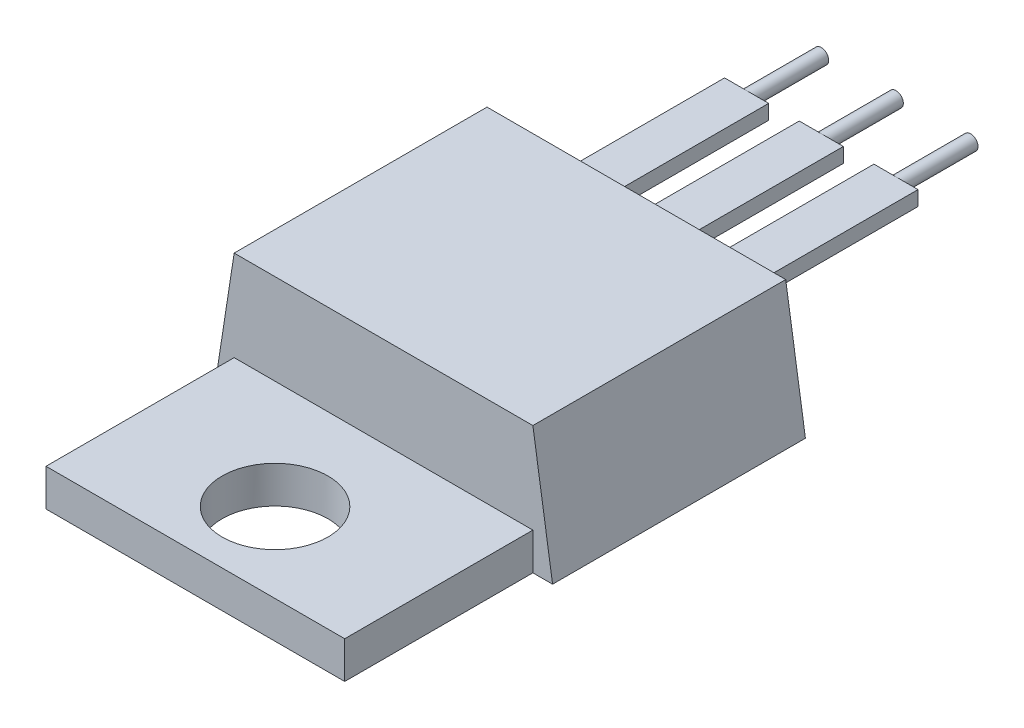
ISO-10303-21;
HEADER;
FILE_DESCRIPTION(('STEP AP214'),'2;1');
FILE_NAME('part.step','',(''),(''),'','','');
FILE_SCHEMA(('AUTOMOTIVE_DESIGN { 1 0 10303 214 1 1 1 1 }'));
ENDSEC;
DATA;
#1=APPLICATION_CONTEXT('core data for automotive mechanical design processes');
#2=APPLICATION_PROTOCOL_DEFINITION('international standard','automotive_design',2000,#1);
#3=PRODUCT_CONTEXT('',#1,'mechanical');
#4=PRODUCT('Part','Part','',(#3));
#5=PRODUCT_RELATED_PRODUCT_CATEGORY('part','',(#4));
#6=PRODUCT_DEFINITION_FORMATION('','',#4);
#7=PRODUCT_DEFINITION_CONTEXT('part definition',#1,'design');
#8=PRODUCT_DEFINITION('design','',#6,#7);
#9=PRODUCT_DEFINITION_SHAPE('','',#8);
#10=(LENGTH_UNIT() NAMED_UNIT(*) SI_UNIT(.MILLI.,.METRE.));
#11=(NAMED_UNIT(*) PLANE_ANGLE_UNIT() SI_UNIT($,.RADIAN.));
#12=(NAMED_UNIT(*) SI_UNIT($,.STERADIAN.) SOLID_ANGLE_UNIT());
#13=UNCERTAINTY_MEASURE_WITH_UNIT(LENGTH_MEASURE(1.E-05),#10,'distance_accuracy_value','');
#14=(GEOMETRIC_REPRESENTATION_CONTEXT(3) GLOBAL_UNCERTAINTY_ASSIGNED_CONTEXT((#13)) GLOBAL_UNIT_ASSIGNED_CONTEXT((#10,
#11,#12)) REPRESENTATION_CONTEXT('',''));
#15=CARTESIAN_POINT('',(0.,0.,0.));
#16=DIRECTION('',(0.,0.,1.));
#17=DIRECTION('',(1.,0.,0.));
#18=AXIS2_PLACEMENT_3D('',#15,#16,#17);
#19=CARTESIAN_POINT('',(-1.79,-0.25,-6.29));
#20=DIRECTION('',(0.,0.,-1.));
#21=DIRECTION('',(-1.,0.,0.));
#22=AXIS2_PLACEMENT_3D('',#19,#20,#21);
#23=PLANE('',#22);
#24=CARTESIAN_POINT('',(-2.54,0.,-6.29));
#25=DIRECTION('',(0.,0.,-1.));
#26=DIRECTION('',(-1.,0.,0.));
#27=AXIS2_PLACEMENT_3D('',#24,#25,#26);
#28=CIRCLE('',#27,0.25);
#29=CARTESIAN_POINT('',(-2.54,0.25,-6.29));
#30=VERTEX_POINT('',#29);
#31=CARTESIAN_POINT('',(-2.54,-0.25,-6.29));
#32=VERTEX_POINT('',#31);
#33=EDGE_CURVE('E52',#30,#32,#28,.T.);
#34=ORIENTED_EDGE('',*,*,#33,.F.);
#35=DIRECTION('',(1.,0.,0.));
#36=VECTOR('',#35,1.);
#37=CARTESIAN_POINT('',(-1.79,0.25,-6.29));
#38=LINE('',#37,#36);
#39=CARTESIAN_POINT('',(-1.79,0.25,-6.29));
#40=VERTEX_POINT('',#39);
#41=EDGE_CURVE('E66',#30,#40,#38,.T.);
#42=ORIENTED_EDGE('',*,*,#41,.T.);
#43=DIRECTION('',(0.,-1.,0.));
#44=VECTOR('',#43,1.);
#45=CARTESIAN_POINT('',(-1.79,0.25,-6.29));
#46=LINE('',#45,#44);
#47=CARTESIAN_POINT('',(-1.79,-0.25,-6.29));
#48=VERTEX_POINT('',#47);
#49=EDGE_CURVE('E159',#40,#48,#46,.T.);
#50=ORIENTED_EDGE('',*,*,#49,.T.);
#51=DIRECTION('',(-1.,0.,0.));
#52=VECTOR('',#51,1.);
#53=CARTESIAN_POINT('',(-1.79,-0.25,-6.29));
#54=LINE('',#53,#52);
#55=EDGE_CURVE('E95',#48,#32,#54,.T.);
#56=ORIENTED_EDGE('',*,*,#55,.T.);
#57=EDGE_LOOP('',(#34,#42,#50,#56));
#58=FACE_BOUND('',#57,.T.);
#59=ADVANCED_FACE('F42',(#58),#23,.T.);
#60=CARTESIAN_POINT('',(-1.79,0.25,-6.29));
#61=DIRECTION('',(-1.,0.,0.));
#62=DIRECTION('',(0.,-1.,0.));
#63=AXIS2_PLACEMENT_3D('',#60,#61,#62);
#64=PLANE('',#63);
#65=DIRECTION('',(0.,-1.,0.));
#66=VECTOR('',#65,1.);
#67=CARTESIAN_POINT('',(-1.79,0.25,0.));
#68=LINE('',#67,#66);
#69=CARTESIAN_POINT('',(-1.79,0.25,0.));
#70=VERTEX_POINT('',#69);
#71=CARTESIAN_POINT('',(-1.79,-0.25,0.));
#72=VERTEX_POINT('',#71);
#73=EDGE_CURVE('E155',#70,#72,#68,.T.);
#74=ORIENTED_EDGE('',*,*,#73,.T.);
#75=DIRECTION('',(0.,0.,1.));
#76=VECTOR('',#75,1.);
#77=CARTESIAN_POINT('',(-1.79,-0.25,-6.29));
#78=LINE('',#77,#76);
#79=EDGE_CURVE('E46',#48,#72,#78,.T.);
#80=ORIENTED_EDGE('',*,*,#79,.F.);
#81=ORIENTED_EDGE('',*,*,#49,.F.);
#82=DIRECTION('',(0.,0.,1.));
#83=VECTOR('',#82,1.);
#84=CARTESIAN_POINT('',(-1.79,0.25,-6.29));
#85=LINE('',#84,#83);
#86=EDGE_CURVE('E103',#40,#70,#85,.T.);
#87=ORIENTED_EDGE('',*,*,#86,.T.);
#88=EDGE_LOOP('',(#74,#80,#81,#87));
#89=FACE_BOUND('',#88,.T.);
#90=ADVANCED_FACE('F44',(#89),#64,.F.);
#91=CARTESIAN_POINT('',(-1.79,-0.25,-6.29));
#92=DIRECTION('',(0.,1.,0.));
#93=DIRECTION('',(0.,0.,1.));
#94=AXIS2_PLACEMENT_3D('',#91,#92,#93);
#95=PLANE('',#94);
#96=DIRECTION('',(-1.,0.,0.));
#97=VECTOR('',#96,1.);
#98=CARTESIAN_POINT('',(-1.79,-0.25,0.));
#99=LINE('',#98,#97);
#100=CARTESIAN_POINT('',(-3.29,-0.25,0.));
#101=VERTEX_POINT('',#100);
#102=EDGE_CURVE('E147',#72,#101,#99,.T.);
#103=ORIENTED_EDGE('',*,*,#102,.T.);
#104=DIRECTION('',(0.,0.,1.));
#105=VECTOR('',#104,1.);
#106=CARTESIAN_POINT('',(-3.29,-0.25,-6.29));
#107=LINE('',#106,#105);
#108=CARTESIAN_POINT('',(-3.29,-0.25,-6.29));
#109=VERTEX_POINT('',#108);
#110=EDGE_CURVE('E149',#109,#101,#107,.T.);
#111=ORIENTED_EDGE('',*,*,#110,.F.);
#112=EDGE_CURVE('E169',#32,#109,#54,.T.);
#113=ORIENTED_EDGE('',*,*,#112,.F.);
#114=ORIENTED_EDGE('',*,*,#55,.F.);
#115=ORIENTED_EDGE('',*,*,#79,.T.);
#116=EDGE_LOOP('',(#103,#111,#113,#114,#115));
#117=FACE_BOUND('',#116,.T.);
#118=ADVANCED_FACE('F130',(#117),#95,.F.);
#119=CARTESIAN_POINT('',(-3.29,0.25,-6.29));
#120=DIRECTION('',(1.,0.,0.));
#121=DIRECTION('',(0.,0.,-1.));
#122=AXIS2_PLACEMENT_3D('',#119,#120,#121);
#123=PLANE('',#122);
#124=DIRECTION('',(0.,1.,0.));
#125=VECTOR('',#124,1.);
#126=CARTESIAN_POINT('',(-3.29,0.25,0.));
#127=LINE('',#126,#125);
#128=CARTESIAN_POINT('',(-3.29,0.25,0.));
#129=VERTEX_POINT('',#128);
#130=EDGE_CURVE('E154',#101,#129,#127,.T.);
#131=ORIENTED_EDGE('',*,*,#130,.T.);
#132=DIRECTION('',(0.,0.,1.));
#133=VECTOR('',#132,1.);
#134=CARTESIAN_POINT('',(-3.29,0.25,-6.29));
#135=LINE('',#134,#133);
#136=CARTESIAN_POINT('',(-3.29,0.25,-6.29));
#137=VERTEX_POINT('',#136);
#138=EDGE_CURVE('E157',#137,#129,#135,.T.);
#139=ORIENTED_EDGE('',*,*,#138,.F.);
#140=DIRECTION('',(0.,1.,0.));
#141=VECTOR('',#140,1.);
#142=CARTESIAN_POINT('',(-3.29,0.25,-6.29));
#143=LINE('',#142,#141);
#144=EDGE_CURVE('E101',#109,#137,#143,.T.);
#145=ORIENTED_EDGE('',*,*,#144,.F.);
#146=ORIENTED_EDGE('',*,*,#110,.T.);
#147=EDGE_LOOP('',(#131,#139,#145,#146));
#148=FACE_BOUND('',#147,.T.);
#149=ADVANCED_FACE('F136',(#148),#123,.F.);
#150=CARTESIAN_POINT('',(-1.79,0.25,-6.29));
#151=DIRECTION('',(0.,-1.,0.));
#152=DIRECTION('',(0.,0.,-1.));
#153=AXIS2_PLACEMENT_3D('',#150,#151,#152);
#154=PLANE('',#153);
#155=DIRECTION('',(1.,0.,0.));
#156=VECTOR('',#155,1.);
#157=CARTESIAN_POINT('',(-1.79,0.25,0.));
#158=LINE('',#157,#156);
#159=EDGE_CURVE('E88',#129,#70,#158,.T.);
#160=ORIENTED_EDGE('',*,*,#159,.T.);
#161=ORIENTED_EDGE('',*,*,#86,.F.);
#162=ORIENTED_EDGE('',*,*,#41,.F.);
#163=EDGE_CURVE('E98',#137,#30,#38,.T.);
#164=ORIENTED_EDGE('',*,*,#163,.F.);
#165=ORIENTED_EDGE('',*,*,#138,.T.);
#166=EDGE_LOOP('',(#160,#161,#162,#164,#165));
#167=FACE_BOUND('',#166,.T.);
#168=ADVANCED_FACE('F105',(#167),#154,.F.);
#169=EDGE_CURVE('E12',#32,#30,#28,.T.);
#170=ORIENTED_EDGE('',*,*,#169,.F.);
#171=ORIENTED_EDGE('',*,*,#112,.T.);
#172=ORIENTED_EDGE('',*,*,#144,.T.);
#173=ORIENTED_EDGE('',*,*,#163,.T.);
#174=EDGE_LOOP('',(#170,#171,#172,#173));
#175=FACE_BOUND('',#174,.T.);
#176=ADVANCED_FACE('F99',(#175),#23,.T.);
#177=CARTESIAN_POINT('',(-1.79,-0.25,0.));
#178=DIRECTION('',(0.,0.,-1.));
#179=DIRECTION('',(-1.,0.,0.));
#180=AXIS2_PLACEMENT_3D('',#177,#178,#179);
#181=PLANE('',#180);
#182=ORIENTED_EDGE('',*,*,#73,.F.);
#183=ORIENTED_EDGE('',*,*,#159,.F.);
#184=ORIENTED_EDGE('',*,*,#130,.F.);
#185=ORIENTED_EDGE('',*,*,#102,.F.);
#186=EDGE_LOOP('',(#182,#183,#184,#185));
#187=FACE_BOUND('',#186,.T.);
#188=ADVANCED_FACE('F113',(#187),#181,.F.);
#189=CARTESIAN_POINT('',(-2.54,0.,-8.83));
#190=DIRECTION('',(0.,0.,1.));
#191=DIRECTION('',(1.,0.,0.));
#192=AXIS2_PLACEMENT_3D('',#189,#190,#191);
#193=CYLINDRICAL_SURFACE('',#192,0.25);
#194=CARTESIAN_POINT('',(-2.54,0.,-8.83));
#195=DIRECTION('',(0.,0.,-1.));
#196=DIRECTION('',(-1.,0.,0.));
#197=AXIS2_PLACEMENT_3D('',#194,#195,#196);
#198=CIRCLE('',#197,0.25);
#199=CARTESIAN_POINT('',(-2.79,0.,-8.83));
#200=VERTEX_POINT('',#199);
#201=EDGE_CURVE('E109',#200,#200,#198,.T.);
#202=ORIENTED_EDGE('',*,*,#201,.F.);
#203=EDGE_LOOP('',(#202));
#204=FACE_BOUND('',#203,.T.);
#205=ORIENTED_EDGE('',*,*,#33,.T.);
#206=ORIENTED_EDGE('',*,*,#169,.T.);
#207=EDGE_LOOP('',(#205,#206));
#208=FACE_BOUND('',#207,.T.);
#209=ADVANCED_FACE('F110',(#204,#208),#193,.T.);
#210=CARTESIAN_POINT('',(-2.54,0.,-8.83));
#211=DIRECTION('',(0.,0.,-1.));
#212=DIRECTION('',(-1.,0.,0.));
#213=AXIS2_PLACEMENT_3D('',#210,#211,#212);
#214=PLANE('',#213);
#215=ORIENTED_EDGE('',*,*,#201,.T.);
#216=EDGE_LOOP('',(#215));
#217=FACE_BOUND('',#216,.T.);
#218=ADVANCED_FACE('F112',(#217),#214,.T.);
#219=CLOSED_SHELL('',(#59,#90,#118,#149,#168,#176,#188,#209,#218));
#220=MANIFOLD_SOLID_BREP('B2',#219);
#221=CARTESIAN_POINT('',(1.79,-0.25,-6.29));
#222=DIRECTION('',(0.,0.,1.));
#223=DIRECTION('',(1.,0.,0.));
#224=AXIS2_PLACEMENT_3D('',#221,#222,#223);
#225=PLANE('',#224);
#226=CARTESIAN_POINT('',(2.54,0.,-6.29));
#227=DIRECTION('',(0.,0.,-1.));
#228=DIRECTION('',(-1.,0.,0.));
#229=AXIS2_PLACEMENT_3D('',#226,#227,#228);
#230=CIRCLE('',#229,0.25);
#231=CARTESIAN_POINT('',(2.54,0.25,-6.29));
#232=VERTEX_POINT('',#231);
#233=CARTESIAN_POINT('',(2.54,-0.25,-6.29));
#234=VERTEX_POINT('',#233);
#235=EDGE_CURVE('E237',#232,#234,#230,.T.);
#236=ORIENTED_EDGE('',*,*,#235,.F.);
#237=DIRECTION('',(1.,0.,0.));
#238=VECTOR('',#237,1.);
#239=CARTESIAN_POINT('',(1.79,0.25,-6.29));
#240=LINE('',#239,#238);
#241=CARTESIAN_POINT('',(3.29,0.25,-6.29));
#242=VERTEX_POINT('',#241);
#243=EDGE_CURVE('E284',#232,#242,#240,.T.);
#244=ORIENTED_EDGE('',*,*,#243,.T.);
#245=DIRECTION('',(0.,-1.,0.));
#246=VECTOR('',#245,1.);
#247=CARTESIAN_POINT('',(3.29,0.25,-6.29));
#248=LINE('',#247,#246);
#249=CARTESIAN_POINT('',(3.29,-0.25,-6.29));
#250=VERTEX_POINT('',#249);
#251=EDGE_CURVE('E283',#242,#250,#248,.T.);
#252=ORIENTED_EDGE('',*,*,#251,.T.);
#253=DIRECTION('',(-1.,0.,0.));
#254=VECTOR('',#253,1.);
#255=CARTESIAN_POINT('',(1.79,-0.25,-6.29));
#256=LINE('',#255,#254);
#257=EDGE_CURVE('E296',#250,#234,#256,.T.);
#258=ORIENTED_EDGE('',*,*,#257,.T.);
#259=EDGE_LOOP('',(#236,#244,#252,#258));
#260=FACE_BOUND('',#259,.T.);
#261=ADVANCED_FACE('F227',(#260),#225,.F.);
#262=EDGE_CURVE('E40',#234,#232,#230,.T.);
#263=ORIENTED_EDGE('',*,*,#262,.F.);
#264=CARTESIAN_POINT('',(1.79,-0.25,-6.29));
#265=VERTEX_POINT('',#264);
#266=EDGE_CURVE('E247',#234,#265,#256,.T.);
#267=ORIENTED_EDGE('',*,*,#266,.T.);
#268=DIRECTION('',(0.,1.,0.));
#269=VECTOR('',#268,1.);
#270=CARTESIAN_POINT('',(1.79,0.25,-6.29));
#271=LINE('',#270,#269);
#272=CARTESIAN_POINT('',(1.79,0.25,-6.29));
#273=VERTEX_POINT('',#272);
#274=EDGE_CURVE('E281',#265,#273,#271,.T.);
#275=ORIENTED_EDGE('',*,*,#274,.T.);
#276=EDGE_CURVE('E276',#273,#232,#240,.T.);
#277=ORIENTED_EDGE('',*,*,#276,.T.);
#278=EDGE_LOOP('',(#263,#267,#275,#277));
#279=FACE_BOUND('',#278,.T.);
#280=ADVANCED_FACE('F279',(#279),#225,.F.);
#281=CARTESIAN_POINT('',(1.79,0.25,-6.29));
#282=DIRECTION('',(1.,0.,0.));
#283=DIRECTION('',(0.,0.,-1.));
#284=AXIS2_PLACEMENT_3D('',#281,#282,#283);
#285=PLANE('',#284);
#286=DIRECTION('',(0.,1.,0.));
#287=VECTOR('',#286,1.);
#288=CARTESIAN_POINT('',(1.79,0.25,0.));
#289=LINE('',#288,#287);
#290=CARTESIAN_POINT('',(1.79,-0.25,0.));
#291=VERTEX_POINT('',#290);
#292=CARTESIAN_POINT('',(1.79,0.25,0.));
#293=VERTEX_POINT('',#292);
#294=EDGE_CURVE('E335',#291,#293,#289,.T.);
#295=ORIENTED_EDGE('',*,*,#294,.T.);
#296=DIRECTION('',(0.,0.,1.));
#297=VECTOR('',#296,1.);
#298=CARTESIAN_POINT('',(1.79,0.25,-6.29));
#299=LINE('',#298,#297);
#300=EDGE_CURVE('E231',#273,#293,#299,.T.);
#301=ORIENTED_EDGE('',*,*,#300,.F.);
#302=ORIENTED_EDGE('',*,*,#274,.F.);
#303=DIRECTION('',(0.,0.,1.));
#304=VECTOR('',#303,1.);
#305=CARTESIAN_POINT('',(1.79,-0.25,-6.29));
#306=LINE('',#305,#304);
#307=EDGE_CURVE('E336',#265,#291,#306,.T.);
#308=ORIENTED_EDGE('',*,*,#307,.T.);
#309=EDGE_LOOP('',(#295,#301,#302,#308));
#310=FACE_BOUND('',#309,.T.);
#311=ADVANCED_FACE('F229',(#310),#285,.F.);
#312=CARTESIAN_POINT('',(1.79,0.25,-6.29));
#313=DIRECTION('',(0.,-1.,0.));
#314=DIRECTION('',(0.,0.,-1.));
#315=AXIS2_PLACEMENT_3D('',#312,#313,#314);
#316=PLANE('',#315);
#317=DIRECTION('',(1.,0.,0.));
#318=VECTOR('',#317,1.);
#319=CARTESIAN_POINT('',(1.79,0.25,0.));
#320=LINE('',#319,#318);
#321=CARTESIAN_POINT('',(3.29,0.25,0.));
#322=VERTEX_POINT('',#321);
#323=EDGE_CURVE('E337',#293,#322,#320,.T.);
#324=ORIENTED_EDGE('',*,*,#323,.T.);
#325=DIRECTION('',(0.,0.,1.));
#326=VECTOR('',#325,1.);
#327=CARTESIAN_POINT('',(3.29,0.25,-6.29));
#328=LINE('',#327,#326);
#329=EDGE_CURVE('E290',#242,#322,#328,.T.);
#330=ORIENTED_EDGE('',*,*,#329,.F.);
#331=ORIENTED_EDGE('',*,*,#243,.F.);
#332=ORIENTED_EDGE('',*,*,#276,.F.);
#333=ORIENTED_EDGE('',*,*,#300,.T.);
#334=EDGE_LOOP('',(#324,#330,#331,#332,#333));
#335=FACE_BOUND('',#334,.T.);
#336=ADVANCED_FACE('F288',(#335),#316,.F.);
#337=CARTESIAN_POINT('',(3.29,0.25,-6.29));
#338=DIRECTION('',(-1.,0.,0.));
#339=DIRECTION('',(0.,0.,1.));
#340=AXIS2_PLACEMENT_3D('',#337,#338,#339);
#341=PLANE('',#340);
#342=DIRECTION('',(0.,-1.,0.));
#343=VECTOR('',#342,1.);
#344=CARTESIAN_POINT('',(3.29,0.25,0.));
#345=LINE('',#344,#343);
#346=CARTESIAN_POINT('',(3.29,-0.25,0.));
#347=VERTEX_POINT('',#346);
#348=EDGE_CURVE('E339',#322,#347,#345,.T.);
#349=ORIENTED_EDGE('',*,*,#348,.T.);
#350=DIRECTION('',(0.,0.,1.));
#351=VECTOR('',#350,1.);
#352=CARTESIAN_POINT('',(3.29,-0.25,-6.29));
#353=LINE('',#352,#351);
#354=EDGE_CURVE('E349',#250,#347,#353,.T.);
#355=ORIENTED_EDGE('',*,*,#354,.F.);
#356=ORIENTED_EDGE('',*,*,#251,.F.);
#357=ORIENTED_EDGE('',*,*,#329,.T.);
#358=EDGE_LOOP('',(#349,#355,#356,#357));
#359=FACE_BOUND('',#358,.T.);
#360=ADVANCED_FACE('F323',(#359),#341,.F.);
#361=CARTESIAN_POINT('',(1.79,-0.25,-6.29));
#362=DIRECTION('',(0.,1.,0.));
#363=DIRECTION('',(0.,0.,1.));
#364=AXIS2_PLACEMENT_3D('',#361,#362,#363);
#365=PLANE('',#364);
#366=DIRECTION('',(-1.,0.,0.));
#367=VECTOR('',#366,1.);
#368=CARTESIAN_POINT('',(1.79,-0.25,0.));
#369=LINE('',#368,#367);
#370=EDGE_CURVE('E269',#347,#291,#369,.T.);
#371=ORIENTED_EDGE('',*,*,#370,.T.);
#372=ORIENTED_EDGE('',*,*,#307,.F.);
#373=ORIENTED_EDGE('',*,*,#266,.F.);
#374=ORIENTED_EDGE('',*,*,#257,.F.);
#375=ORIENTED_EDGE('',*,*,#354,.T.);
#376=EDGE_LOOP('',(#371,#372,#373,#374,#375));
#377=FACE_BOUND('',#376,.T.);
#378=ADVANCED_FACE('F311',(#377),#365,.F.);
#379=CARTESIAN_POINT('',(1.79,-0.25,0.));
#380=DIRECTION('',(0.,0.,1.));
#381=DIRECTION('',(1.,0.,0.));
#382=AXIS2_PLACEMENT_3D('',#379,#380,#381);
#383=PLANE('',#382);
#384=ORIENTED_EDGE('',*,*,#294,.F.);
#385=ORIENTED_EDGE('',*,*,#370,.F.);
#386=ORIENTED_EDGE('',*,*,#348,.F.);
#387=ORIENTED_EDGE('',*,*,#323,.F.);
#388=EDGE_LOOP('',(#384,#385,#386,#387));
#389=FACE_BOUND('',#388,.T.);
#390=ADVANCED_FACE('F302',(#389),#383,.T.);
#391=CARTESIAN_POINT('',(2.54,0.,-8.83));
#392=DIRECTION('',(0.,0.,1.));
#393=DIRECTION('',(1.,0.,0.));
#394=AXIS2_PLACEMENT_3D('',#391,#392,#393);
#395=CYLINDRICAL_SURFACE('',#394,0.25);
#396=CARTESIAN_POINT('',(2.54,0.,-8.83));
#397=DIRECTION('',(0.,0.,-1.));
#398=DIRECTION('',(-1.,0.,0.));
#399=AXIS2_PLACEMENT_3D('',#396,#397,#398);
#400=CIRCLE('',#399,0.25);
#401=CARTESIAN_POINT('',(2.29,0.,-8.83));
#402=VERTEX_POINT('',#401);
#403=EDGE_CURVE('E298',#402,#402,#400,.T.);
#404=ORIENTED_EDGE('',*,*,#403,.F.);
#405=EDGE_LOOP('',(#404));
#406=FACE_BOUND('',#405,.T.);
#407=ORIENTED_EDGE('',*,*,#235,.T.);
#408=ORIENTED_EDGE('',*,*,#262,.T.);
#409=EDGE_LOOP('',(#407,#408));
#410=FACE_BOUND('',#409,.T.);
#411=ADVANCED_FACE('F299',(#406,#410),#395,.T.);
#412=CARTESIAN_POINT('',(2.54,0.,-8.83));
#413=DIRECTION('',(0.,0.,-1.));
#414=DIRECTION('',(-1.,0.,0.));
#415=AXIS2_PLACEMENT_3D('',#412,#413,#414);
#416=PLANE('',#415);
#417=ORIENTED_EDGE('',*,*,#403,.T.);
#418=EDGE_LOOP('',(#417));
#419=FACE_BOUND('',#418,.T.);
#420=ADVANCED_FACE('F301',(#419),#416,.T.);
#421=CLOSED_SHELL('',(#261,#280,#311,#336,#360,#378,#390,#411,#420));
#422=MANIFOLD_SOLID_BREP('B6',#421);
#423=CARTESIAN_POINT('',(0.75,-0.25,-6.29));
#424=DIRECTION('',(0.,0.,-1.));
#425=DIRECTION('',(-1.,0.,0.));
#426=AXIS2_PLACEMENT_3D('',#423,#424,#425);
#427=PLANE('',#426);
#428=CARTESIAN_POINT('',(0.,0.,-6.29));
#429=DIRECTION('',(0.,0.,-1.));
#430=DIRECTION('',(-1.,0.,0.));
#431=AXIS2_PLACEMENT_3D('',#428,#429,#430);
#432=CIRCLE('',#431,0.25);
#433=CARTESIAN_POINT('',(0.,0.25,-6.29));
#434=VERTEX_POINT('',#433);
#435=CARTESIAN_POINT('',(0.,-0.25,-6.29));
#436=VERTEX_POINT('',#435);
#437=EDGE_CURVE('E422',#434,#436,#432,.T.);
#438=ORIENTED_EDGE('',*,*,#437,.F.);
#439=DIRECTION('',(1.,0.,0.));
#440=VECTOR('',#439,1.);
#441=CARTESIAN_POINT('',(0.75,0.25,-6.29));
#442=LINE('',#441,#440);
#443=CARTESIAN_POINT('',(0.75,0.25,-6.29));
#444=VERTEX_POINT('',#443);
#445=EDGE_CURVE('E436',#434,#444,#442,.T.);
#446=ORIENTED_EDGE('',*,*,#445,.T.);
#447=DIRECTION('',(0.,-1.,0.));
#448=VECTOR('',#447,1.);
#449=CARTESIAN_POINT('',(0.75,0.25,-6.29));
#450=LINE('',#449,#448);
#451=CARTESIAN_POINT('',(0.75,-0.25,-6.29));
#452=VERTEX_POINT('',#451);
#453=EDGE_CURVE('E529',#444,#452,#450,.T.);
#454=ORIENTED_EDGE('',*,*,#453,.T.);
#455=DIRECTION('',(-1.,0.,0.));
#456=VECTOR('',#455,1.);
#457=CARTESIAN_POINT('',(0.75,-0.25,-6.29));
#458=LINE('',#457,#456);
#459=EDGE_CURVE('E465',#452,#436,#458,.T.);
#460=ORIENTED_EDGE('',*,*,#459,.T.);
#461=EDGE_LOOP('',(#438,#446,#454,#460));
#462=FACE_BOUND('',#461,.T.);
#463=ADVANCED_FACE('F412',(#462),#427,.T.);
#464=CARTESIAN_POINT('',(0.75,0.25,-6.29));
#465=DIRECTION('',(-1.,0.,0.));
#466=DIRECTION('',(0.,0.,1.));
#467=AXIS2_PLACEMENT_3D('',#464,#465,#466);
#468=PLANE('',#467);
#469=DIRECTION('',(0.,-1.,0.));
#470=VECTOR('',#469,1.);
#471=CARTESIAN_POINT('',(0.75,0.25,0.));
#472=LINE('',#471,#470);
#473=CARTESIAN_POINT('',(0.75,0.25,0.));
#474=VERTEX_POINT('',#473);
#475=CARTESIAN_POINT('',(0.75,-0.25,0.));
#476=VERTEX_POINT('',#475);
#477=EDGE_CURVE('E525',#474,#476,#472,.T.);
#478=ORIENTED_EDGE('',*,*,#477,.T.);
#479=DIRECTION('',(0.,0.,1.));
#480=VECTOR('',#479,1.);
#481=CARTESIAN_POINT('',(0.75,-0.25,-6.29));
#482=LINE('',#481,#480);
#483=EDGE_CURVE('E416',#452,#476,#482,.T.);
#484=ORIENTED_EDGE('',*,*,#483,.F.);
#485=ORIENTED_EDGE('',*,*,#453,.F.);
#486=DIRECTION('',(0.,0.,1.));
#487=VECTOR('',#486,1.);
#488=CARTESIAN_POINT('',(0.75,0.25,-6.29));
#489=LINE('',#488,#487);
#490=EDGE_CURVE('E473',#444,#474,#489,.T.);
#491=ORIENTED_EDGE('',*,*,#490,.T.);
#492=EDGE_LOOP('',(#478,#484,#485,#491));
#493=FACE_BOUND('',#492,.T.);
#494=ADVANCED_FACE('F414',(#493),#468,.F.);
#495=CARTESIAN_POINT('',(0.75,-0.25,-6.29));
#496=DIRECTION('',(0.,1.,0.));
#497=DIRECTION('',(0.,0.,1.));
#498=AXIS2_PLACEMENT_3D('',#495,#496,#497);
#499=PLANE('',#498);
#500=DIRECTION('',(-1.,0.,0.));
#501=VECTOR('',#500,1.);
#502=CARTESIAN_POINT('',(0.75,-0.25,0.));
#503=LINE('',#502,#501);
#504=CARTESIAN_POINT('',(-0.75,-0.25,0.));
#505=VERTEX_POINT('',#504);
#506=EDGE_CURVE('E517',#476,#505,#503,.T.);
#507=ORIENTED_EDGE('',*,*,#506,.T.);
#508=DIRECTION('',(0.,0.,1.));
#509=VECTOR('',#508,1.);
#510=CARTESIAN_POINT('',(-0.75,-0.25,-6.29));
#511=LINE('',#510,#509);
#512=CARTESIAN_POINT('',(-0.75,-0.25,-6.29));
#513=VERTEX_POINT('',#512);
#514=EDGE_CURVE('E519',#513,#505,#511,.T.);
#515=ORIENTED_EDGE('',*,*,#514,.F.);
#516=EDGE_CURVE('E539',#436,#513,#458,.T.);
#517=ORIENTED_EDGE('',*,*,#516,.F.);
#518=ORIENTED_EDGE('',*,*,#459,.F.);
#519=ORIENTED_EDGE('',*,*,#483,.T.);
#520=EDGE_LOOP('',(#507,#515,#517,#518,#519));
#521=FACE_BOUND('',#520,.T.);
#522=ADVANCED_FACE('F500',(#521),#499,.F.);
#523=CARTESIAN_POINT('',(-0.75,0.25,-6.29));
#524=DIRECTION('',(1.,0.,0.));
#525=DIRECTION('',(0.,0.,-1.));
#526=AXIS2_PLACEMENT_3D('',#523,#524,#525);
#527=PLANE('',#526);
#528=DIRECTION('',(0.,1.,0.));
#529=VECTOR('',#528,1.);
#530=CARTESIAN_POINT('',(-0.75,0.25,0.));
#531=LINE('',#530,#529);
#532=CARTESIAN_POINT('',(-0.75,0.25,0.));
#533=VERTEX_POINT('',#532);
#534=EDGE_CURVE('E524',#505,#533,#531,.T.);
#535=ORIENTED_EDGE('',*,*,#534,.T.);
#536=DIRECTION('',(0.,0.,1.));
#537=VECTOR('',#536,1.);
#538=CARTESIAN_POINT('',(-0.75,0.25,-6.29));
#539=LINE('',#538,#537);
#540=CARTESIAN_POINT('',(-0.75,0.25,-6.29));
#541=VERTEX_POINT('',#540);
#542=EDGE_CURVE('E527',#541,#533,#539,.T.);
#543=ORIENTED_EDGE('',*,*,#542,.F.);
#544=DIRECTION('',(0.,1.,0.));
#545=VECTOR('',#544,1.);
#546=CARTESIAN_POINT('',(-0.75,0.25,-6.29));
#547=LINE('',#546,#545);
#548=EDGE_CURVE('E471',#513,#541,#547,.T.);
#549=ORIENTED_EDGE('',*,*,#548,.F.);
#550=ORIENTED_EDGE('',*,*,#514,.T.);
#551=EDGE_LOOP('',(#535,#543,#549,#550));
#552=FACE_BOUND('',#551,.T.);
#553=ADVANCED_FACE('F506',(#552),#527,.F.);
#554=CARTESIAN_POINT('',(0.75,0.25,-6.29));
#555=DIRECTION('',(0.,-1.,0.));
#556=DIRECTION('',(0.,0.,-1.));
#557=AXIS2_PLACEMENT_3D('',#554,#555,#556);
#558=PLANE('',#557);
#559=DIRECTION('',(1.,0.,0.));
#560=VECTOR('',#559,1.);
#561=CARTESIAN_POINT('',(0.75,0.25,0.));
#562=LINE('',#561,#560);
#563=EDGE_CURVE('E458',#533,#474,#562,.T.);
#564=ORIENTED_EDGE('',*,*,#563,.T.);
#565=ORIENTED_EDGE('',*,*,#490,.F.);
#566=ORIENTED_EDGE('',*,*,#445,.F.);
#567=EDGE_CURVE('E468',#541,#434,#442,.T.);
#568=ORIENTED_EDGE('',*,*,#567,.F.);
#569=ORIENTED_EDGE('',*,*,#542,.T.);
#570=EDGE_LOOP('',(#564,#565,#566,#568,#569));
#571=FACE_BOUND('',#570,.T.);
#572=ADVANCED_FACE('F475',(#571),#558,.F.);
#573=EDGE_CURVE('E225',#436,#434,#432,.T.);
#574=ORIENTED_EDGE('',*,*,#573,.F.);
#575=ORIENTED_EDGE('',*,*,#516,.T.);
#576=ORIENTED_EDGE('',*,*,#548,.T.);
#577=ORIENTED_EDGE('',*,*,#567,.T.);
#578=EDGE_LOOP('',(#574,#575,#576,#577));
#579=FACE_BOUND('',#578,.T.);
#580=ADVANCED_FACE('F469',(#579),#427,.T.);
#581=CARTESIAN_POINT('',(0.75,-0.25,0.));
#582=DIRECTION('',(0.,0.,-1.));
#583=DIRECTION('',(-1.,0.,0.));
#584=AXIS2_PLACEMENT_3D('',#581,#582,#583);
#585=PLANE('',#584);
#586=ORIENTED_EDGE('',*,*,#477,.F.);
#587=ORIENTED_EDGE('',*,*,#563,.F.);
#588=ORIENTED_EDGE('',*,*,#534,.F.);
#589=ORIENTED_EDGE('',*,*,#506,.F.);
#590=EDGE_LOOP('',(#586,#587,#588,#589));
#591=FACE_BOUND('',#590,.T.);
#592=ADVANCED_FACE('F483',(#591),#585,.F.);
#593=CARTESIAN_POINT('',(0.,0.,-8.83));
#594=DIRECTION('',(0.,0.,1.));
#595=DIRECTION('',(1.,0.,0.));
#596=AXIS2_PLACEMENT_3D('',#593,#594,#595);
#597=CYLINDRICAL_SURFACE('',#596,0.25);
#598=CARTESIAN_POINT('',(0.,0.,-8.83));
#599=DIRECTION('',(0.,0.,-1.));
#600=DIRECTION('',(-1.,0.,0.));
#601=AXIS2_PLACEMENT_3D('',#598,#599,#600);
#602=CIRCLE('',#601,0.25);
#603=CARTESIAN_POINT('',(-0.25,0.,-8.83));
#604=VERTEX_POINT('',#603);
#605=EDGE_CURVE('E479',#604,#604,#602,.T.);
#606=ORIENTED_EDGE('',*,*,#605,.F.);
#607=EDGE_LOOP('',(#606));
#608=FACE_BOUND('',#607,.T.);
#609=ORIENTED_EDGE('',*,*,#437,.T.);
#610=ORIENTED_EDGE('',*,*,#573,.T.);
#611=EDGE_LOOP('',(#609,#610));
#612=FACE_BOUND('',#611,.T.);
#613=ADVANCED_FACE('F480',(#608,#612),#597,.T.);
#614=CARTESIAN_POINT('',(0.,0.,-8.83));
#615=DIRECTION('',(0.,0.,-1.));
#616=DIRECTION('',(-1.,0.,0.));
#617=AXIS2_PLACEMENT_3D('',#614,#615,#616);
#618=PLANE('',#617);
#619=ORIENTED_EDGE('',*,*,#605,.T.);
#620=EDGE_LOOP('',(#619));
#621=FACE_BOUND('',#620,.T.);
#622=ADVANCED_FACE('F482',(#621),#618,.T.);
#623=CLOSED_SHELL('',(#463,#494,#522,#553,#572,#580,#592,#613,#622));
#624=MANIFOLD_SOLID_BREP('B34',#623);
#625=CARTESIAN_POINT('',(-5.08,-2.7,1.));
#626=DIRECTION('',(-1.,0.,0.));
#627=DIRECTION('',(0.,0.,1.));
#628=AXIS2_PLACEMENT_3D('',#625,#626,#627);
#629=PLANE('',#628);
#630=DIRECTION('',(0.,0.,1.));
#631=VECTOR('',#630,1.);
#632=CARTESIAN_POINT('',(-5.08,-2.7,1.));
#633=LINE('',#632,#631);
#634=CARTESIAN_POINT('',(-5.08,-2.7,1.));
#635=VERTEX_POINT('',#634);
#636=CARTESIAN_POINT('',(-5.08,-2.7,15.));
#637=VERTEX_POINT('',#636);
#638=EDGE_CURVE('E599',#635,#637,#633,.T.);
#639=ORIENTED_EDGE('',*,*,#638,.T.);
#640=DIRECTION('',(0.,-1.,0.));
#641=VECTOR('',#640,1.);
#642=CARTESIAN_POINT('',(-5.08,-2.7,15.));
#643=LINE('',#642,#641);
#644=CARTESIAN_POINT('',(-5.08,-1.44,15.));
#645=VERTEX_POINT('',#644);
#646=EDGE_CURVE('E636',#645,#637,#643,.T.);
#647=ORIENTED_EDGE('',*,*,#646,.F.);
#648=DIRECTION('',(0.,0.,1.));
#649=VECTOR('',#648,1.);
#650=CARTESIAN_POINT('',(-5.08,-1.44,1.));
#651=LINE('',#650,#649);
#652=CARTESIAN_POINT('',(-5.08,-1.44,1.));
#653=VERTEX_POINT('',#652);
#654=EDGE_CURVE('E410',#653,#645,#651,.T.);
#655=ORIENTED_EDGE('',*,*,#654,.F.);
#656=DIRECTION('',(0.,-1.,0.));
#657=VECTOR('',#656,1.);
#658=CARTESIAN_POINT('',(-5.08,-2.7,1.));
#659=LINE('',#658,#657);
#660=EDGE_CURVE('E637',#653,#635,#659,.T.);
#661=ORIENTED_EDGE('',*,*,#660,.T.);
#662=EDGE_LOOP('',(#639,#647,#655,#661));
#663=FACE_BOUND('',#662,.T.);
#664=ADVANCED_FACE('F596',(#663),#629,.T.);
#665=CARTESIAN_POINT('',(-5.08,-1.44,1.));
#666=DIRECTION('',(0.,1.,0.));
#667=DIRECTION('',(0.,0.,1.));
#668=AXIS2_PLACEMENT_3D('',#665,#666,#667);
#669=PLANE('',#668);
#670=CARTESIAN_POINT('',(0.,-1.44,12.29));
#671=DIRECTION('',(0.,1.,0.));
#672=DIRECTION('',(0.,0.,1.));
#673=AXIS2_PLACEMENT_3D('',#670,#671,#672);
#674=CIRCLE('',#673,1.8);
#675=CARTESIAN_POINT('',(0.,-1.44,14.09));
#676=VERTEX_POINT('',#675);
#677=EDGE_CURVE('E657',#676,#676,#674,.T.);
#678=ORIENTED_EDGE('',*,*,#677,.F.);
#679=EDGE_LOOP('',(#678));
#680=FACE_BOUND('',#679,.T.);
#681=ORIENTED_EDGE('',*,*,#654,.T.);
#682=DIRECTION('',(-1.,0.,0.));
#683=VECTOR('',#682,1.);
#684=CARTESIAN_POINT('',(-5.08,-1.44,15.));
#685=LINE('',#684,#683);
#686=CARTESIAN_POINT('',(5.08,-1.44,15.));
#687=VERTEX_POINT('',#686);
#688=EDGE_CURVE('E653',#687,#645,#685,.T.);
#689=ORIENTED_EDGE('',*,*,#688,.F.);
#690=DIRECTION('',(0.,0.,1.));
#691=VECTOR('',#690,1.);
#692=CARTESIAN_POINT('',(5.08,-1.44,1.));
#693=LINE('',#692,#691);
#694=CARTESIAN_POINT('',(5.08,-1.44,1.));
#695=VERTEX_POINT('',#694);
#696=EDGE_CURVE('E604',#695,#687,#693,.T.);
#697=ORIENTED_EDGE('',*,*,#696,.F.);
#698=DIRECTION('',(-1.,0.,0.));
#699=VECTOR('',#698,1.);
#700=CARTESIAN_POINT('',(-5.08,-1.44,1.));
#701=LINE('',#700,#699);
#702=EDGE_CURVE('E642',#695,#653,#701,.T.);
#703=ORIENTED_EDGE('',*,*,#702,.T.);
#704=EDGE_LOOP('',(#681,#689,#697,#703));
#705=FACE_BOUND('',#704,.T.);
#706=ADVANCED_FACE('F673',(#680,#705),#669,.T.);
#707=CARTESIAN_POINT('',(5.08,-2.7,1.));
#708=DIRECTION('',(1.,0.,0.));
#709=DIRECTION('',(0.,0.,-1.));
#710=AXIS2_PLACEMENT_3D('',#707,#708,#709);
#711=PLANE('',#710);
#712=ORIENTED_EDGE('',*,*,#696,.T.);
#713=DIRECTION('',(0.,1.,0.));
#714=VECTOR('',#713,1.);
#715=CARTESIAN_POINT('',(5.08,-2.7,15.));
#716=LINE('',#715,#714);
#717=CARTESIAN_POINT('',(5.08,-2.7,15.));
#718=VERTEX_POINT('',#717);
#719=EDGE_CURVE('E649',#718,#687,#716,.T.);
#720=ORIENTED_EDGE('',*,*,#719,.F.);
#721=DIRECTION('',(0.,0.,1.));
#722=VECTOR('',#721,1.);
#723=CARTESIAN_POINT('',(5.08,-2.7,1.));
#724=LINE('',#723,#722);
#725=CARTESIAN_POINT('',(5.08,-2.7,1.));
#726=VERTEX_POINT('',#725);
#727=EDGE_CURVE('E641',#726,#718,#724,.T.);
#728=ORIENTED_EDGE('',*,*,#727,.F.);
#729=DIRECTION('',(0.,1.,0.));
#730=VECTOR('',#729,1.);
#731=CARTESIAN_POINT('',(5.08,-2.7,1.));
#732=LINE('',#731,#730);
#733=EDGE_CURVE('E666',#726,#695,#732,.T.);
#734=ORIENTED_EDGE('',*,*,#733,.T.);
#735=EDGE_LOOP('',(#712,#720,#728,#734));
#736=FACE_BOUND('',#735,.T.);
#737=ADVANCED_FACE('F670',(#736),#711,.T.);
#738=CARTESIAN_POINT('',(-5.08,-2.7,1.));
#739=DIRECTION('',(0.,-1.,0.));
#740=DIRECTION('',(0.,0.,-1.));
#741=AXIS2_PLACEMENT_3D('',#738,#739,#740);
#742=PLANE('',#741);
#743=CARTESIAN_POINT('',(0.,-2.7,12.29));
#744=DIRECTION('',(0.,-1.,0.));
#745=DIRECTION('',(0.,0.,-1.));
#746=AXIS2_PLACEMENT_3D('',#743,#744,#745);
#747=CIRCLE('',#746,1.8);
#748=CARTESIAN_POINT('',(0.,-2.7,10.49));
#749=VERTEX_POINT('',#748);
#750=EDGE_CURVE('E654',#749,#749,#747,.F.);
#751=ORIENTED_EDGE('',*,*,#750,.T.);
#752=EDGE_LOOP('',(#751));
#753=FACE_BOUND('',#752,.T.);
#754=ORIENTED_EDGE('',*,*,#727,.T.);
#755=DIRECTION('',(1.,0.,0.));
#756=VECTOR('',#755,1.);
#757=CARTESIAN_POINT('',(-5.08,-2.7,15.));
#758=LINE('',#757,#756);
#759=EDGE_CURVE('E644',#637,#718,#758,.T.);
#760=ORIENTED_EDGE('',*,*,#759,.F.);
#761=ORIENTED_EDGE('',*,*,#638,.F.);
#762=DIRECTION('',(1.,0.,0.));
#763=VECTOR('',#762,1.);
#764=CARTESIAN_POINT('',(-5.08,-2.7,1.));
#765=LINE('',#764,#763);
#766=EDGE_CURVE('E664',#635,#726,#765,.T.);
#767=ORIENTED_EDGE('',*,*,#766,.T.);
#768=EDGE_LOOP('',(#754,#760,#761,#767));
#769=FACE_BOUND('',#768,.T.);
#770=ADVANCED_FACE('F645',(#753,#769),#742,.T.);
#771=CARTESIAN_POINT('',(-5.08,-1.44,1.));
#772=DIRECTION('',(0.,0.,-1.));
#773=DIRECTION('',(-1.,0.,0.));
#774=AXIS2_PLACEMENT_3D('',#771,#772,#773);
#775=PLANE('',#774);
#776=ORIENTED_EDGE('',*,*,#660,.F.);
#777=ORIENTED_EDGE('',*,*,#702,.F.);
#778=ORIENTED_EDGE('',*,*,#733,.F.);
#779=ORIENTED_EDGE('',*,*,#766,.F.);
#780=EDGE_LOOP('',(#776,#777,#778,#779));
#781=FACE_BOUND('',#780,.T.);
#782=ADVANCED_FACE('F675',(#781),#775,.T.);
#783=CARTESIAN_POINT('',(-5.08,-1.44,15.));
#784=DIRECTION('',(0.,0.,-1.));
#785=DIRECTION('',(-1.,0.,0.));
#786=AXIS2_PLACEMENT_3D('',#783,#784,#785);
#787=PLANE('',#786);
#788=ORIENTED_EDGE('',*,*,#646,.T.);
#789=ORIENTED_EDGE('',*,*,#759,.T.);
#790=ORIENTED_EDGE('',*,*,#719,.T.);
#791=ORIENTED_EDGE('',*,*,#688,.T.);
#792=EDGE_LOOP('',(#788,#789,#790,#791));
#793=FACE_BOUND('',#792,.T.);
#794=ADVANCED_FACE('F652',(#793),#787,.F.);
#795=CARTESIAN_POINT('',(0.,-7.79116882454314,12.29));
#796=DIRECTION('',(0.,1.,0.));
#797=DIRECTION('',(0.,0.,1.));
#798=AXIS2_PLACEMENT_3D('',#795,#796,#797);
#799=CYLINDRICAL_SURFACE('',#798,1.8);
#800=ORIENTED_EDGE('',*,*,#677,.T.);
#801=EDGE_LOOP('',(#800));
#802=FACE_BOUND('',#801,.T.);
#803=ORIENTED_EDGE('',*,*,#750,.F.);
#804=EDGE_LOOP('',(#803));
#805=FACE_BOUND('',#804,.T.);
#806=ADVANCED_FACE('F682',(#802,#805),#799,.F.);
#807=CLOSED_SHELL('',(#664,#706,#737,#770,#782,#794,#806));
#808=MANIFOLD_SOLID_BREP('B219',#807);
#809=CARTESIAN_POINT('',(-5.75,-2.7,8.6));
#810=DIRECTION('',(0.988292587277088,-0.152570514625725,0.));
#811=DIRECTION('',(0.152570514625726,0.988292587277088,0.));
#812=AXIS2_PLACEMENT_3D('',#809,#810,#811);
#813=PLANE('',#812);
#814=DIRECTION('',(-0.152570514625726,-0.988292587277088,0.));
#815=VECTOR('',#814,1.);
#816=CARTESIAN_POINT('',(-5.75,-2.7,0.));
#817=LINE('',#816,#815);
#818=CARTESIAN_POINT('',(-5.08,1.64,0.));
#819=VERTEX_POINT('',#818);
#820=CARTESIAN_POINT('',(-5.75,-2.7,0.));
#821=VERTEX_POINT('',#820);
#822=EDGE_CURVE('E804',#819,#821,#817,.T.);
#823=ORIENTED_EDGE('',*,*,#822,.T.);
#824=DIRECTION('',(0.,0.,-1.));
#825=VECTOR('',#824,1.);
#826=CARTESIAN_POINT('',(-5.75,-2.7,8.6));
#827=LINE('',#826,#825);
#828=CARTESIAN_POINT('',(-5.75,-2.7,8.6));
#829=VERTEX_POINT('',#828);
#830=EDGE_CURVE('E594',#829,#821,#827,.T.);
#831=ORIENTED_EDGE('',*,*,#830,.F.);
#832=DIRECTION('',(-0.152570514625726,-0.988292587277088,0.));
#833=VECTOR('',#832,1.);
#834=CARTESIAN_POINT('',(-5.75,-2.7,8.6));
#835=LINE('',#834,#833);
#836=CARTESIAN_POINT('',(-5.08,1.64,8.6));
#837=VERTEX_POINT('',#836);
#838=EDGE_CURVE('E792',#837,#829,#835,.T.);
#839=ORIENTED_EDGE('',*,*,#838,.F.);
#840=DIRECTION('',(0.,0.,-1.));
#841=VECTOR('',#840,1.);
#842=CARTESIAN_POINT('',(-5.08,1.64,8.6));
#843=LINE('',#842,#841);
#844=EDGE_CURVE('E800',#837,#819,#843,.T.);
#845=ORIENTED_EDGE('',*,*,#844,.T.);
#846=EDGE_LOOP('',(#823,#831,#839,#845));
#847=FACE_BOUND('',#846,.T.);
#848=ADVANCED_FACE('F741',(#847),#813,.F.);
#849=CARTESIAN_POINT('',(-5.75,-2.7,8.6));
#850=DIRECTION('',(0.,1.,0.));
#851=DIRECTION('',(0.,0.,1.));
#852=AXIS2_PLACEMENT_3D('',#849,#850,#851);
#853=PLANE('',#852);
#854=DIRECTION('',(1.,0.,0.));
#855=VECTOR('',#854,1.);
#856=CARTESIAN_POINT('',(-5.75,-2.7,0.));
#857=LINE('',#856,#855);
#858=CARTESIAN_POINT('',(5.75,-2.7,0.));
#859=VERTEX_POINT('',#858);
#860=EDGE_CURVE('E796',#821,#859,#857,.T.);
#861=ORIENTED_EDGE('',*,*,#860,.T.);
#862=DIRECTION('',(0.,0.,-1.));
#863=VECTOR('',#862,1.);
#864=CARTESIAN_POINT('',(5.75,-2.7,8.6));
#865=LINE('',#864,#863);
#866=CARTESIAN_POINT('',(5.75,-2.7,8.6));
#867=VERTEX_POINT('',#866);
#868=EDGE_CURVE('E749',#867,#859,#865,.T.);
#869=ORIENTED_EDGE('',*,*,#868,.F.);
#870=DIRECTION('',(1.,0.,0.));
#871=VECTOR('',#870,1.);
#872=CARTESIAN_POINT('',(-5.75,-2.7,8.6));
#873=LINE('',#872,#871);
#874=EDGE_CURVE('E787',#829,#867,#873,.T.);
#875=ORIENTED_EDGE('',*,*,#874,.F.);
#876=ORIENTED_EDGE('',*,*,#830,.T.);
#877=EDGE_LOOP('',(#861,#869,#875,#876));
#878=FACE_BOUND('',#877,.T.);
#879=ADVANCED_FACE('F795',(#878),#853,.F.);
#880=CARTESIAN_POINT('',(5.75,-2.7,8.6));
#881=DIRECTION('',(-0.988292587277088,-0.152570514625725,0.));
#882=DIRECTION('',(0.152570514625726,-0.988292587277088,0.));
#883=AXIS2_PLACEMENT_3D('',#880,#881,#882);
#884=PLANE('',#883);
#885=DIRECTION('',(-0.152570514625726,0.988292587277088,0.));
#886=VECTOR('',#885,1.);
#887=CARTESIAN_POINT('',(5.75,-2.7,0.));
#888=LINE('',#887,#886);
#889=CARTESIAN_POINT('',(5.08,1.64,0.));
#890=VERTEX_POINT('',#889);
#891=EDGE_CURVE('E774',#859,#890,#888,.T.);
#892=ORIENTED_EDGE('',*,*,#891,.T.);
#893=DIRECTION('',(0.,0.,-1.));
#894=VECTOR('',#893,1.);
#895=CARTESIAN_POINT('',(5.08,1.64,8.6));
#896=LINE('',#895,#894);
#897=CARTESIAN_POINT('',(5.08,1.64,8.6));
#898=VERTEX_POINT('',#897);
#899=EDGE_CURVE('E797',#898,#890,#896,.T.);
#900=ORIENTED_EDGE('',*,*,#899,.F.);
#901=DIRECTION('',(-0.152570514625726,0.988292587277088,0.));
#902=VECTOR('',#901,1.);
#903=CARTESIAN_POINT('',(5.75,-2.7,8.6));
#904=LINE('',#903,#902);
#905=EDGE_CURVE('E790',#867,#898,#904,.T.);
#906=ORIENTED_EDGE('',*,*,#905,.F.);
#907=ORIENTED_EDGE('',*,*,#868,.T.);
#908=EDGE_LOOP('',(#892,#900,#906,#907));
#909=FACE_BOUND('',#908,.T.);
#910=ADVANCED_FACE('F798',(#909),#884,.F.);
#911=CARTESIAN_POINT('',(-5.08,1.64,8.6));
#912=DIRECTION('',(0.,-1.,0.));
#913=DIRECTION('',(0.,0.,-1.));
#914=AXIS2_PLACEMENT_3D('',#911,#912,#913);
#915=PLANE('',#914);
#916=DIRECTION('',(-1.,0.,0.));
#917=VECTOR('',#916,1.);
#918=CARTESIAN_POINT('',(-5.08,1.64,0.));
#919=LINE('',#918,#917);
#920=EDGE_CURVE('E780',#890,#819,#919,.T.);
#921=ORIENTED_EDGE('',*,*,#920,.T.);
#922=ORIENTED_EDGE('',*,*,#844,.F.);
#923=DIRECTION('',(-1.,0.,0.));
#924=VECTOR('',#923,1.);
#925=CARTESIAN_POINT('',(-5.08,1.64,8.6));
#926=LINE('',#925,#924);
#927=EDGE_CURVE('E757',#898,#837,#926,.T.);
#928=ORIENTED_EDGE('',*,*,#927,.F.);
#929=ORIENTED_EDGE('',*,*,#899,.T.);
#930=EDGE_LOOP('',(#921,#922,#928,#929));
#931=FACE_BOUND('',#930,.T.);
#932=ADVANCED_FACE('F811',(#931),#915,.F.);
#933=CARTESIAN_POINT('',(-5.08,1.64,8.6));
#934=DIRECTION('',(0.,0.,-1.));
#935=DIRECTION('',(-1.,0.,0.));
#936=AXIS2_PLACEMENT_3D('',#933,#934,#935);
#937=PLANE('',#936);
#938=ORIENTED_EDGE('',*,*,#838,.T.);
#939=ORIENTED_EDGE('',*,*,#874,.T.);
#940=ORIENTED_EDGE('',*,*,#905,.T.);
#941=ORIENTED_EDGE('',*,*,#927,.T.);
#942=EDGE_LOOP('',(#938,#939,#940,#941));
#943=FACE_BOUND('',#942,.T.);
#944=ADVANCED_FACE('F788',(#943),#937,.F.);
#945=CARTESIAN_POINT('',(-5.08,1.64,0.));
#946=DIRECTION('',(0.,0.,-1.));
#947=DIRECTION('',(-1.,0.,0.));
#948=AXIS2_PLACEMENT_3D('',#945,#946,#947);
#949=PLANE('',#948);
#950=ORIENTED_EDGE('',*,*,#822,.F.);
#951=ORIENTED_EDGE('',*,*,#920,.F.);
#952=ORIENTED_EDGE('',*,*,#891,.F.);
#953=ORIENTED_EDGE('',*,*,#860,.F.);
#954=EDGE_LOOP('',(#950,#951,#952,#953));
#955=FACE_BOUND('',#954,.T.);
#956=ADVANCED_FACE('F814',(#955),#949,.T.);
#957=CLOSED_SHELL('',(#848,#879,#910,#932,#944,#956));
#958=MANIFOLD_SOLID_BREP('B404',#957);
#959=ADVANCED_BREP_SHAPE_REPRESENTATION('',(#18,#220,#422,#624,#808,#958),#14);
#960=SHAPE_DEFINITION_REPRESENTATION(#9,#959);
ENDSEC;
END-ISO-10303-21;
